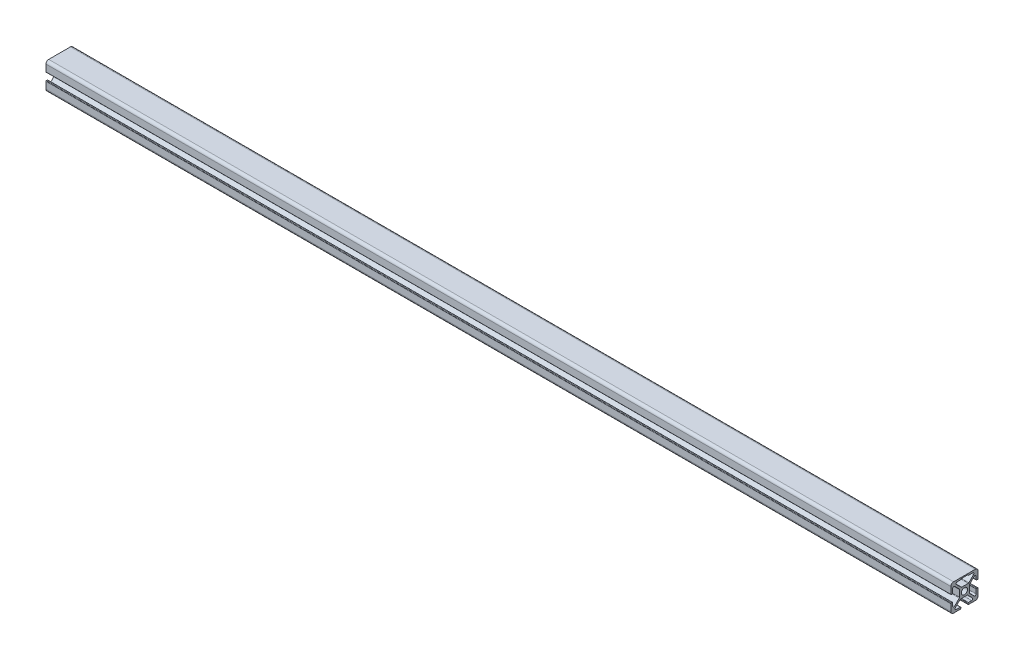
from build123d import *

# Parameters (mm, degrees)
MODEL_R                = 3.4
STRUKTURBAUTEIL1_DEPTH = 1000


with BuildPart() as part:
    # Model → Strukturbauteil1 (new body)
    with BuildSketch(Plane(origin=(0, 0, 0), x_dir=(0, 0, -1), z_dir=(1, 0, 0))):
        with BuildLine():
            Line((-14.5, 4), (-13.5, 4))
            ThreePointArc((-13.5, 4), (-13.146446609, 4.146446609), (-13, 4.5))
            Line((-13, 4.5), (-13, 9.1022583))
            ThreePointArc((-13, 9.1022583), (-12.198882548, 10.301215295), (-10.784616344, 10.019900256))
            Line((-10.784616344, 10.019900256), (-5.692893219, 4.928177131))
            ThreePointArc((-5.692893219, 4.928177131), (-5.476120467, 4.603753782), (-5.4, 4.22107035))
            Line((-5.4, 4.22107035), (-5.4, -3.02107035))
            ThreePointArc((-5.4, -3.02107035), (-5.476120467, -3.403753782), (-5.692893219, -3.728177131))
            Line((-5.692893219, -3.728177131), (-10.784616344, -8.819900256))
            ThreePointArc((-10.784616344, -8.819900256), (-12.198882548, -9.101215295), (-13, -7.9022583))
            Line((-13, -7.9022583), (-13, -4.5))
            ThreePointArc((-13, -4.5), (-13.146446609, -4.146446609), (-13.5, -4))
            Line((-13.5, -4), (-14.5, -4))
            ThreePointArc((-14.5, -4), (-14.853553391, -4.146446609), (-15, -4.5))
            Line((-15, -4.5), (-15, -12))
            ThreePointArc((-15, -12), (-14.121320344, -14.121320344), (-12, -15))
            Line((-12, -15), (-4.5, -15))
            ThreePointArc((-4.5, -15), (-4.146446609, -14.853553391), (-4, -14.5))
            Line((-4, -14.5), (-4, -13.5))
            ThreePointArc((-4, -13.5), (-4.146446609, -13.146446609), (-4.5, -13))
            Line((-4.5, -13), (-9.1022583, -13))
            ThreePointArc((-9.1022583, -13), (-10.301215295, -12.198882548), (-10.019900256, -10.784616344))
            Line((-10.019900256, -10.784616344), (-4.928177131, -5.692893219))
            ThreePointArc((-4.928177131, -5.692893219), (-4.603753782, -5.476120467), (-4.22107035, -5.4))
            Line((-4.22107035, -5.4), (3.02107035, -5.4))
            ThreePointArc((3.02107035, -5.4), (3.403753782, -5.476120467), (3.728177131, -5.692893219))
            Line((3.728177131, -5.692893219), (8.819900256, -10.784616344))
            ThreePointArc((8.819900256, -10.784616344), (9.101215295, -12.198882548), (7.9022583, -13))
            Line((7.9022583, -13), (4.5, -13))
            ThreePointArc((4.5, -13), (4.146446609, -13.146446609), (4, -13.5))
            Line((4, -13.5), (4, -14.5))
            ThreePointArc((4, -14.5), (4.146446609, -14.853553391), (4.5, -15))
            Line((4.5, -15), (12, -15))
            ThreePointArc((12, -15), (14.121320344, -14.121320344), (15, -12))
            Line((15, -12), (15, -4.5))
            ThreePointArc((15, -4.5), (14.853553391, -4.146446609), (14.5, -4))
            Line((14.5, -4), (13.5, -4))
            ThreePointArc((13.5, -4), (13.146446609, -4.146446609), (13, -4.5))
            Line((13, -4.5), (13, -9.1022583))
            ThreePointArc((13, -9.1022583), (12.198882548, -10.301215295), (10.784616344, -10.019900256))
            Line((10.784616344, -10.019900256), (5.692893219, -4.928177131))
            ThreePointArc((5.692893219, -4.928177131), (5.476120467, -4.603753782), (5.4, -4.22107035))
            Line((5.4, -4.22107035), (5.4, 3.02107035))
            ThreePointArc((5.4, 3.02107035), (5.476120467, 3.403753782), (5.692893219, 3.728177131))
            Line((5.692893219, 3.728177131), (10.784616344, 8.819900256))
            ThreePointArc((10.784616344, 8.819900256), (12.198882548, 9.101215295), (13, 7.9022583))
            Line((13, 7.9022583), (13, 4.5))
            ThreePointArc((13, 4.5), (13.146446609, 4.146446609), (13.5, 4))
            Line((13.5, 4), (14.5, 4))
            ThreePointArc((14.5, 4), (14.853553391, 4.146446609), (15, 4.5))
            Line((15, 4.5), (15, 12))
            ThreePointArc((15, 12), (14.121320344, 14.121320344), (12, 15))
            Line((12, 15), (-12, 15))
            ThreePointArc((-12, 15), (-14.121320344, 14.121320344), (-15, 12))
            Line((-15, 12), (-15, 4.5))
            ThreePointArc((-15, 4.5), (-14.853553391, 4.146446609), (-14.5, 4))
        make_face()
        Circle(MODEL_R, mode=Mode.SUBTRACT)
        with BuildLine():
            Line((3.7, 13.8), (-3.7, 13.8))
            ThreePointArc((-3.7, 13.8), (-3.912132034, 13.712132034), (-4, 13.5))
            ThreePointArc((-4, 13.5), (-4.146446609, 13.146446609), (-4.5, 13))
            Line((-4.5, 13), (-7.9022583, 13))
            ThreePointArc((-7.9022583, 13), (-9.101215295, 12.198882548), (-8.819900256, 10.784616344))
            Line((-8.819900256, 10.784616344), (-3.728177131, 5.692893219))
            ThreePointArc((-3.728177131, 5.692893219), (-3.403753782, 5.476120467), (-3.02107035, 5.4))
            Line((-3.02107035, 5.4), (4.22107035, 5.4))
            ThreePointArc((4.22107035, 5.4), (4.603753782, 5.476120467), (4.928177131, 5.692893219))
            Line((4.928177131, 5.692893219), (10.019900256, 10.784616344))
            ThreePointArc((10.019900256, 10.784616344), (10.301215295, 12.198882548), (9.1022583, 13))
            Line((9.1022583, 13), (4.5, 13))
            ThreePointArc((4.5, 13), (4.146446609, 13.146446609), (4, 13.5))
            ThreePointArc((4, 13.5), (3.912132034, 13.712132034), (3.7, 13.8))
        make_face(mode=Mode.SUBTRACT)
    extrude(amount=STRUKTURBAUTEIL1_DEPTH)


solid = part.part
